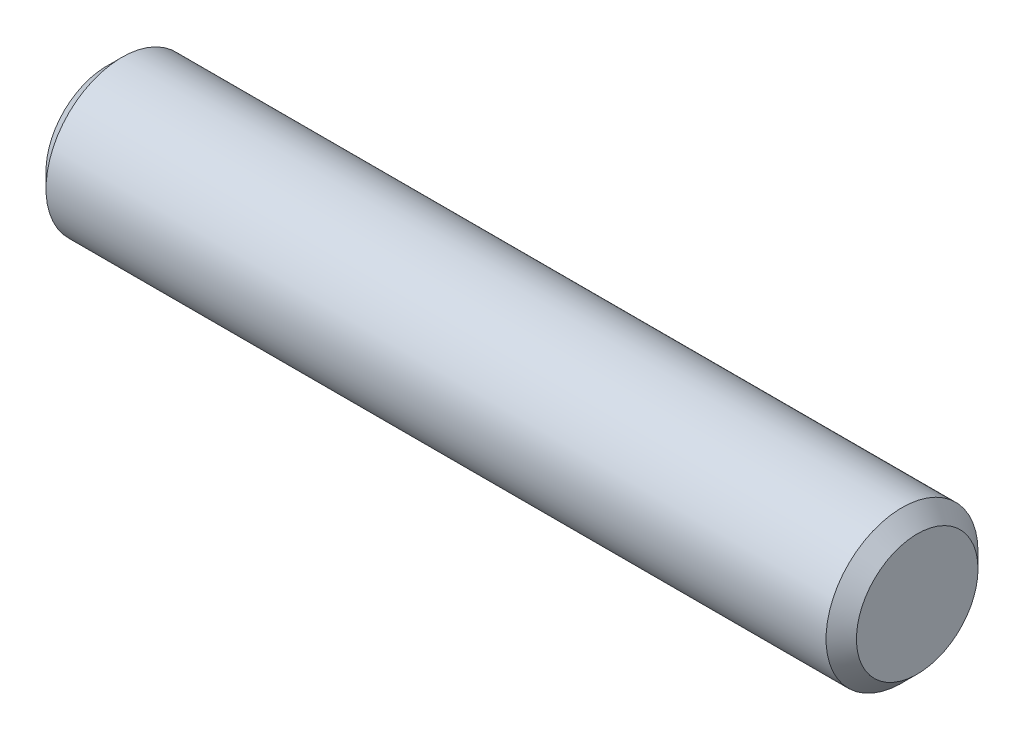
ISO-10303-21;
HEADER;
FILE_DESCRIPTION(('STEP AP214'),'2;1');
FILE_NAME('part.step','',(''),(''),'','','');
FILE_SCHEMA(('AUTOMOTIVE_DESIGN { 1 0 10303 214 1 1 1 1 }'));
ENDSEC;
DATA;
#1=APPLICATION_CONTEXT('core data for automotive mechanical design processes');
#2=APPLICATION_PROTOCOL_DEFINITION('international standard','automotive_design',2000,#1);
#3=PRODUCT_CONTEXT('',#1,'mechanical');
#4=PRODUCT('Part','Part','',(#3));
#5=PRODUCT_RELATED_PRODUCT_CATEGORY('part','',(#4));
#6=PRODUCT_DEFINITION_FORMATION('','',#4);
#7=PRODUCT_DEFINITION_CONTEXT('part definition',#1,'design');
#8=PRODUCT_DEFINITION('design','',#6,#7);
#9=PRODUCT_DEFINITION_SHAPE('','',#8);
#10=(LENGTH_UNIT() NAMED_UNIT(*) SI_UNIT(.MILLI.,.METRE.));
#11=(NAMED_UNIT(*) PLANE_ANGLE_UNIT() SI_UNIT($,.RADIAN.));
#12=(NAMED_UNIT(*) SI_UNIT($,.STERADIAN.) SOLID_ANGLE_UNIT());
#13=UNCERTAINTY_MEASURE_WITH_UNIT(LENGTH_MEASURE(1.E-05),#10,'distance_accuracy_value','');
#14=(GEOMETRIC_REPRESENTATION_CONTEXT(3) GLOBAL_UNCERTAINTY_ASSIGNED_CONTEXT((#13)) GLOBAL_UNIT_ASSIGNED_CONTEXT((#10,
#11,#12)) REPRESENTATION_CONTEXT('',''));
#15=CARTESIAN_POINT('',(0.,0.,0.));
#16=DIRECTION('',(0.,0.,1.));
#17=DIRECTION('',(1.,0.,0.));
#18=AXIS2_PLACEMENT_3D('',#15,#16,#17);
#19=CARTESIAN_POINT('',(-3.175,0.,0.));
#20=DIRECTION('',(1.,0.,0.));
#21=DIRECTION('',(0.,0.,-1.));
#22=AXIS2_PLACEMENT_3D('',#19,#20,#21);
#23=CYLINDRICAL_SURFACE('',#22,0.5953125);
#24=CARTESIAN_POINT('',(3.0559375,0.,0.));
#25=DIRECTION('',(1.,0.,0.));
#26=DIRECTION('',(0.,0.,-1.));
#27=AXIS2_PLACEMENT_3D('',#24,#25,#26);
#28=CIRCLE('',#27,0.5953125);
#29=CARTESIAN_POINT('',(3.0559375,0.,-0.5953125));
#30=VERTEX_POINT('',#29);
#31=EDGE_CURVE('E38',#30,#30,#28,.F.);
#32=ORIENTED_EDGE('',*,*,#31,.T.);
#33=EDGE_LOOP('',(#32));
#34=FACE_BOUND('',#33,.T.);
#35=CARTESIAN_POINT('',(-3.0559375,0.,0.));
#36=DIRECTION('',(1.,0.,0.));
#37=DIRECTION('',(0.,0.,-1.));
#38=AXIS2_PLACEMENT_3D('',#35,#36,#37);
#39=CIRCLE('',#38,0.5953125);
#40=CARTESIAN_POINT('',(-3.0559375,0.,-0.5953125));
#41=VERTEX_POINT('',#40);
#42=EDGE_CURVE('E42',#41,#41,#39,.T.);
#43=ORIENTED_EDGE('',*,*,#42,.T.);
#44=EDGE_LOOP('',(#43));
#45=FACE_BOUND('',#44,.T.);
#46=ADVANCED_FACE('F31',(#34,#45),#23,.T.);
#47=CARTESIAN_POINT('',(-3.175,0.,0.));
#48=DIRECTION('',(1.,0.,0.));
#49=DIRECTION('',(0.,0.,-1.));
#50=AXIS2_PLACEMENT_3D('',#47,#48,#49);
#51=PLANE('',#50);
#52=CARTESIAN_POINT('',(-3.175,0.,0.));
#53=DIRECTION('',(1.,0.,0.));
#54=DIRECTION('',(0.,0.,-1.));
#55=AXIS2_PLACEMENT_3D('',#52,#53,#54);
#56=CIRCLE('',#55,0.47625);
#57=CARTESIAN_POINT('',(-3.175,0.,-0.47625));
#58=VERTEX_POINT('',#57);
#59=EDGE_CURVE('E10',#58,#58,#56,.F.);
#60=ORIENTED_EDGE('',*,*,#59,.T.);
#61=EDGE_LOOP('',(#60));
#62=FACE_BOUND('',#61,.T.);
#63=ADVANCED_FACE('F62',(#62),#51,.F.);
#64=CARTESIAN_POINT('',(3.175,0.,0.));
#65=DIRECTION('',(1.,0.,0.));
#66=DIRECTION('',(0.,0.,-1.));
#67=AXIS2_PLACEMENT_3D('',#64,#65,#66);
#68=PLANE('',#67);
#69=CARTESIAN_POINT('',(3.175,0.,0.));
#70=DIRECTION('',(1.,0.,0.));
#71=DIRECTION('',(0.,0.,-1.));
#72=AXIS2_PLACEMENT_3D('',#69,#70,#71);
#73=CIRCLE('',#72,0.47625);
#74=CARTESIAN_POINT('',(3.175,0.,-0.47625));
#75=VERTEX_POINT('',#74);
#76=EDGE_CURVE('E46',#75,#75,#73,.T.);
#77=ORIENTED_EDGE('',*,*,#76,.T.);
#78=EDGE_LOOP('',(#77));
#79=FACE_BOUND('',#78,.T.);
#80=ADVANCED_FACE('F52',(#79),#68,.T.);
#81=CARTESIAN_POINT('',(3.175,0.,0.));
#82=DIRECTION('',(-1.,0.,0.));
#83=DIRECTION('',(0.,0.,1.));
#84=AXIS2_PLACEMENT_3D('',#81,#82,#83);
#85=CONICAL_SURFACE('',#84,0.47625,0.785398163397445);
#86=ORIENTED_EDGE('',*,*,#31,.F.);
#87=EDGE_LOOP('',(#86));
#88=FACE_BOUND('',#87,.T.);
#89=ORIENTED_EDGE('',*,*,#76,.F.);
#90=EDGE_LOOP('',(#89));
#91=FACE_BOUND('',#90,.T.);
#92=ADVANCED_FACE('F54',(#88,#91),#85,.T.);
#93=CARTESIAN_POINT('',(-3.0559375,0.,0.));
#94=DIRECTION('',(1.,0.,0.));
#95=DIRECTION('',(0.,0.,-1.));
#96=AXIS2_PLACEMENT_3D('',#93,#94,#95);
#97=CONICAL_SURFACE('',#96,0.5953125,0.78539816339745);
#98=ORIENTED_EDGE('',*,*,#59,.F.);
#99=EDGE_LOOP('',(#98));
#100=FACE_BOUND('',#99,.T.);
#101=ORIENTED_EDGE('',*,*,#42,.F.);
#102=EDGE_LOOP('',(#101));
#103=FACE_BOUND('',#102,.T.);
#104=ADVANCED_FACE('F33',(#100,#103),#97,.T.);
#105=CLOSED_SHELL('',(#46,#63,#80,#92,#104));
#106=MANIFOLD_SOLID_BREP('B2',#105);
#107=ADVANCED_BREP_SHAPE_REPRESENTATION('',(#18,#106),#14);
#108=SHAPE_DEFINITION_REPRESENTATION(#9,#107);
ENDSEC;
END-ISO-10303-21;
